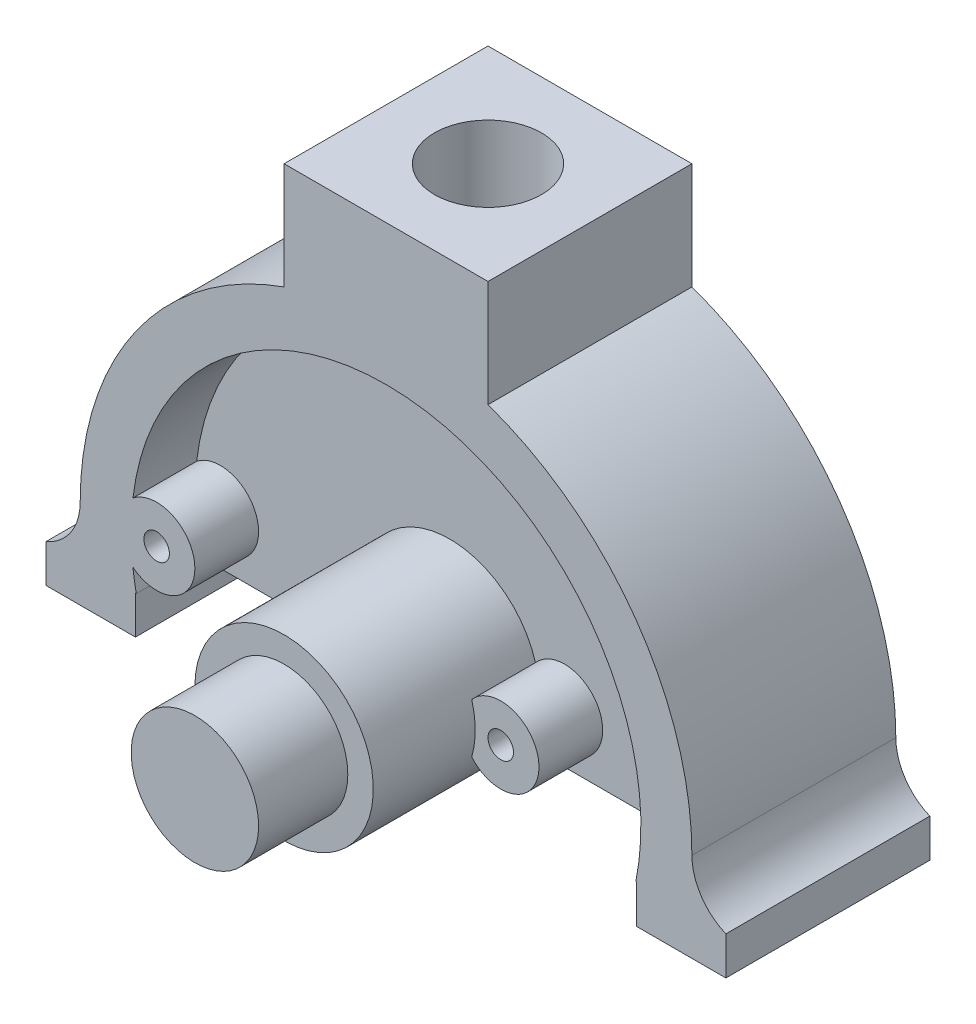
ISO-10303-21;
HEADER;
FILE_DESCRIPTION(('STEP AP214'),'2;1');
FILE_NAME('part.step','',(''),(''),'','','');
FILE_SCHEMA(('AUTOMOTIVE_DESIGN { 1 0 10303 214 1 1 1 1 }'));
ENDSEC;
DATA;
#1=APPLICATION_CONTEXT('core data for automotive mechanical design processes');
#2=APPLICATION_PROTOCOL_DEFINITION('international standard','automotive_design',2000,#1);
#3=PRODUCT_CONTEXT('',#1,'mechanical');
#4=PRODUCT('Part','Part','',(#3));
#5=PRODUCT_RELATED_PRODUCT_CATEGORY('part','',(#4));
#6=PRODUCT_DEFINITION_FORMATION('','',#4);
#7=PRODUCT_DEFINITION_CONTEXT('part definition',#1,'design');
#8=PRODUCT_DEFINITION('design','',#6,#7);
#9=PRODUCT_DEFINITION_SHAPE('','',#8);
#10=(LENGTH_UNIT() NAMED_UNIT(*) SI_UNIT(.MILLI.,.METRE.));
#11=(NAMED_UNIT(*) PLANE_ANGLE_UNIT() SI_UNIT($,.RADIAN.));
#12=(NAMED_UNIT(*) SI_UNIT($,.STERADIAN.) SOLID_ANGLE_UNIT());
#13=UNCERTAINTY_MEASURE_WITH_UNIT(LENGTH_MEASURE(1.E-05),#10,'distance_accuracy_value','');
#14=(GEOMETRIC_REPRESENTATION_CONTEXT(3) GLOBAL_UNCERTAINTY_ASSIGNED_CONTEXT((#13)) GLOBAL_UNIT_ASSIGNED_CONTEXT((#10,
#11,#12)) REPRESENTATION_CONTEXT('',''));
#15=CARTESIAN_POINT('',(0.,0.,0.));
#16=DIRECTION('',(0.,0.,1.));
#17=DIRECTION('',(1.,0.,0.));
#18=AXIS2_PLACEMENT_3D('',#15,#16,#17);
#19=CARTESIAN_POINT('',(0.,10.5000000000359,3.99999999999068));
#20=DIRECTION('',(0.,1.,0.));
#21=DIRECTION('',(0.,0.,1.));
#22=AXIS2_PLACEMENT_3D('',#19,#20,#21);
#23=CONICAL_SURFACE('',#22,2.10000000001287,1.02974425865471);
#24=CARTESIAN_POINT('',(0.,9.23819270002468,3.99999999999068));
#25=VERTEX_POINT('',#24);
#26=VERTEX_LOOP('',#25);
#27=FACE_BOUND('',#26,.T.);
#28=CARTESIAN_POINT('',(0.,10.5,3.99999999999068));
#29=DIRECTION('',(0.,1.,0.));
#30=DIRECTION('',(0.,0.,1.));
#31=AXIS2_PLACEMENT_3D('',#28,#29,#30);
#32=CIRCLE('',#31,2.09999999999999);
#33=CARTESIAN_POINT('',(0.,10.5,6.09999999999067));
#34=VERTEX_POINT('',#33);
#35=EDGE_CURVE('E209',#34,#34,#32,.T.);
#36=ORIENTED_EDGE('',*,*,#35,.T.);
#37=EDGE_LOOP('',(#36));
#38=FACE_BOUND('',#37,.T.);
#39=ADVANCED_FACE('F17',(#27,#38),#23,.F.);
#40=CARTESIAN_POINT('',(0.,0.,5.5));
#41=DIRECTION('',(0.,0.,-1.));
#42=DIRECTION('',(-1.,0.,0.));
#43=AXIS2_PLACEMENT_3D('',#40,#41,#42);
#44=PLANE('',#43);
#45=CARTESIAN_POINT('',(4.5,0.,5.5));
#46=DIRECTION('',(0.,0.,-1.));
#47=DIRECTION('',(-1.,0.,0.));
#48=AXIS2_PLACEMENT_3D('',#45,#46,#47);
#49=CIRCLE('',#48,0.5);
#50=CARTESIAN_POINT('',(4.,0.,5.5));
#51=VERTEX_POINT('',#50);
#52=EDGE_CURVE('E20',#51,#51,#49,.F.);
#53=ORIENTED_EDGE('',*,*,#52,.T.);
#54=EDGE_LOOP('',(#53));
#55=FACE_BOUND('',#54,.T.);
#56=ADVANCED_FACE('F476',(#55),#44,.F.);
#57=CARTESIAN_POINT('',(0.,0.,5.5));
#58=DIRECTION('',(0.,0.,-1.));
#59=DIRECTION('',(-1.,0.,0.));
#60=AXIS2_PLACEMENT_3D('',#57,#58,#59);
#61=PLANE('',#60);
#62=CARTESIAN_POINT('',(-9.,0.,5.5));
#63=DIRECTION('',(0.,0.,-1.));
#64=DIRECTION('',(-1.,0.,0.));
#65=AXIS2_PLACEMENT_3D('',#62,#63,#64);
#66=CIRCLE('',#65,0.5);
#67=CARTESIAN_POINT('',(-9.5,0.,5.5));
#68=VERTEX_POINT('',#67);
#69=EDGE_CURVE('E193',#68,#68,#66,.F.);
#70=ORIENTED_EDGE('',*,*,#69,.T.);
#71=EDGE_LOOP('',(#70));
#72=FACE_BOUND('',#71,.T.);
#73=ADVANCED_FACE('F482',(#72),#61,.F.);
#74=CARTESIAN_POINT('',(0.,15.5,3.99999999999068));
#75=DIRECTION('',(0.,1.,0.));
#76=DIRECTION('',(0.,0.,1.));
#77=AXIS2_PLACEMENT_3D('',#74,#75,#76);
#78=CYLINDRICAL_SURFACE('',#77,2.09999999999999);
#79=CARTESIAN_POINT('',(0.,15.5,3.99999999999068));
#80=DIRECTION('',(0.,1.,0.));
#81=DIRECTION('',(0.,0.,1.));
#82=AXIS2_PLACEMENT_3D('',#79,#80,#81);
#83=CIRCLE('',#82,2.09999999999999);
#84=CARTESIAN_POINT('',(0.,15.5,6.09999999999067));
#85=VERTEX_POINT('',#84);
#86=EDGE_CURVE('E189',#85,#85,#83,.F.);
#87=ORIENTED_EDGE('',*,*,#86,.F.);
#88=EDGE_LOOP('',(#87));
#89=FACE_BOUND('',#88,.T.);
#90=ORIENTED_EDGE('',*,*,#35,.F.);
#91=EDGE_LOOP('',(#90));
#92=FACE_BOUND('',#91,.T.);
#93=ADVANCED_FACE('F479',(#89,#92),#78,.F.);
#94=CARTESIAN_POINT('',(-13.3321595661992,-3.5,8.));
#95=DIRECTION('',(1.,0.,0.));
#96=DIRECTION('',(0.,1.,0.));
#97=AXIS2_PLACEMENT_3D('',#94,#95,#96);
#98=PLANE('',#97);
#99=DIRECTION('',(0.,0.,1.));
#100=VECTOR('',#99,1.);
#101=CARTESIAN_POINT('',(-13.3321595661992,-3.5,8.));
#102=LINE('',#101,#100);
#103=CARTESIAN_POINT('',(-13.3321595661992,-3.5,0.));
#104=VERTEX_POINT('',#103);
#105=CARTESIAN_POINT('',(-13.3321595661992,-3.5,8.));
#106=VERTEX_POINT('',#105);
#107=EDGE_CURVE('E188',#104,#106,#102,.T.);
#108=ORIENTED_EDGE('',*,*,#107,.T.);
#109=DIRECTION('',(0.,1.,0.));
#110=VECTOR('',#109,1.);
#111=CARTESIAN_POINT('',(-13.3321595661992,-3.5,8.));
#112=LINE('',#111,#110);
#113=CARTESIAN_POINT('',(-13.3321595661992,-2.,8.));
#114=VERTEX_POINT('',#113);
#115=EDGE_CURVE('E204',#114,#106,#112,.F.);
#116=ORIENTED_EDGE('',*,*,#115,.F.);
#117=DIRECTION('',(0.,0.,-1.));
#118=VECTOR('',#117,1.);
#119=CARTESIAN_POINT('',(-13.3321595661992,-2.,8.));
#120=LINE('',#119,#118);
#121=CARTESIAN_POINT('',(-13.3321595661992,-2.,0.));
#122=VERTEX_POINT('',#121);
#123=EDGE_CURVE('E155',#114,#122,#120,.T.);
#124=ORIENTED_EDGE('',*,*,#123,.T.);
#125=DIRECTION('',(0.,1.,0.));
#126=VECTOR('',#125,1.);
#127=CARTESIAN_POINT('',(-13.3321595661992,-3.5,0.));
#128=LINE('',#127,#126);
#129=EDGE_CURVE('E201',#104,#122,#128,.T.);
#130=ORIENTED_EDGE('',*,*,#129,.F.);
#131=EDGE_LOOP('',(#108,#116,#124,#130));
#132=FACE_BOUND('',#131,.T.);
#133=ADVANCED_FACE('F481',(#132),#98,.F.);
#134=CARTESIAN_POINT('',(0.,0.,15.5));
#135=DIRECTION('',(0.,0.,-1.));
#136=DIRECTION('',(-1.,0.,0.));
#137=AXIS2_PLACEMENT_3D('',#134,#135,#136);
#138=PLANE('',#137);
#139=CARTESIAN_POINT('',(0.,0.,15.5));
#140=DIRECTION('',(0.,0.,1.));
#141=DIRECTION('',(1.,0.,0.));
#142=AXIS2_PLACEMENT_3D('',#139,#140,#141);
#143=CIRCLE('',#142,2.5);
#144=CARTESIAN_POINT('',(2.5,0.,15.5));
#145=VERTEX_POINT('',#144);
#146=EDGE_CURVE('E185',#145,#145,#143,.F.);
#147=ORIENTED_EDGE('',*,*,#146,.F.);
#148=EDGE_LOOP('',(#147));
#149=FACE_BOUND('',#148,.T.);
#150=ADVANCED_FACE('F490',(#149),#138,.F.);
#151=CARTESIAN_POINT('',(0.,0.,-4.5));
#152=DIRECTION('',(0.,0.,-1.));
#153=DIRECTION('',(-1.,0.,0.));
#154=AXIS2_PLACEMENT_3D('',#151,#152,#153);
#155=PLANE('',#154);
#156=CARTESIAN_POINT('',(0.,0.,-4.5));
#157=DIRECTION('',(0.,0.,-1.));
#158=DIRECTION('',(-1.,0.,0.));
#159=AXIS2_PLACEMENT_3D('',#156,#157,#158);
#160=CIRCLE('',#159,2.5);
#161=CARTESIAN_POINT('',(-2.5,0.,-4.5));
#162=VERTEX_POINT('',#161);
#163=EDGE_CURVE('E182',#162,#162,#160,.F.);
#164=ORIENTED_EDGE('',*,*,#163,.F.);
#165=EDGE_LOOP('',(#164));
#166=FACE_BOUND('',#165,.T.);
#167=ADVANCED_FACE('F607',(#166),#155,.T.);
#168=CARTESIAN_POINT('',(4.5,0.,8.));
#169=DIRECTION('',(0.,0.,-1.));
#170=DIRECTION('',(-1.,0.,0.));
#171=AXIS2_PLACEMENT_3D('',#168,#169,#170);
#172=CYLINDRICAL_SURFACE('',#171,0.5);
#173=CARTESIAN_POINT('',(4.5,0.,8.));
#174=DIRECTION('',(0.,0.,-1.));
#175=DIRECTION('',(-1.,0.,0.));
#176=AXIS2_PLACEMENT_3D('',#173,#174,#175);
#177=CIRCLE('',#176,0.5);
#178=CARTESIAN_POINT('',(4.,0.,8.));
#179=VERTEX_POINT('',#178);
#180=EDGE_CURVE('E179',#179,#179,#177,.T.);
#181=ORIENTED_EDGE('',*,*,#180,.F.);
#182=EDGE_LOOP('',(#181));
#183=FACE_BOUND('',#182,.T.);
#184=ORIENTED_EDGE('',*,*,#52,.F.);
#185=EDGE_LOOP('',(#184));
#186=FACE_BOUND('',#185,.T.);
#187=ADVANCED_FACE('F603',(#183,#186),#172,.F.);
#188=CARTESIAN_POINT('',(-9.,0.,8.));
#189=DIRECTION('',(0.,0.,-1.));
#190=DIRECTION('',(-1.,0.,0.));
#191=AXIS2_PLACEMENT_3D('',#188,#189,#190);
#192=CYLINDRICAL_SURFACE('',#191,0.5);
#193=ORIENTED_EDGE('',*,*,#69,.F.);
#194=EDGE_LOOP('',(#193));
#195=FACE_BOUND('',#194,.T.);
#196=CARTESIAN_POINT('',(-9.,0.,8.));
#197=DIRECTION('',(0.,0.,-1.));
#198=DIRECTION('',(-1.,0.,0.));
#199=AXIS2_PLACEMENT_3D('',#196,#197,#198);
#200=CIRCLE('',#199,0.5);
#201=CARTESIAN_POINT('',(-9.5,0.,8.));
#202=VERTEX_POINT('',#201);
#203=EDGE_CURVE('E309',#202,#202,#200,.F.);
#204=ORIENTED_EDGE('',*,*,#203,.T.);
#205=EDGE_LOOP('',(#204));
#206=FACE_BOUND('',#205,.T.);
#207=ADVANCED_FACE('F600',(#195,#206),#192,.F.);
#208=CARTESIAN_POINT('',(13.3321595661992,-3.5,8.));
#209=DIRECTION('',(-1.,0.,0.));
#210=DIRECTION('',(0.,-1.,0.));
#211=AXIS2_PLACEMENT_3D('',#208,#209,#210);
#212=PLANE('',#211);
#213=DIRECTION('',(0.,0.,-1.));
#214=VECTOR('',#213,1.);
#215=CARTESIAN_POINT('',(13.3321595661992,-2.,8.));
#216=LINE('',#215,#214);
#217=CARTESIAN_POINT('',(13.3321595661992,-2.,0.));
#218=VERTEX_POINT('',#217);
#219=CARTESIAN_POINT('',(13.3321595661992,-2.,8.));
#220=VERTEX_POINT('',#219);
#221=EDGE_CURVE('E369',#218,#220,#216,.F.);
#222=ORIENTED_EDGE('',*,*,#221,.T.);
#223=DIRECTION('',(0.,1.,0.));
#224=VECTOR('',#223,1.);
#225=CARTESIAN_POINT('',(13.3321595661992,1.00665441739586E-13,8.));
#226=LINE('',#225,#224);
#227=CARTESIAN_POINT('',(13.3321595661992,-3.5,8.));
#228=VERTEX_POINT('',#227);
#229=EDGE_CURVE('E316',#220,#228,#226,.F.);
#230=ORIENTED_EDGE('',*,*,#229,.T.);
#231=DIRECTION('',(0.,0.,1.));
#232=VECTOR('',#231,1.);
#233=CARTESIAN_POINT('',(13.3321595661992,-3.5,8.));
#234=LINE('',#233,#232);
#235=CARTESIAN_POINT('',(13.3321595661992,-3.5,0.));
#236=VERTEX_POINT('',#235);
#237=EDGE_CURVE('E308',#228,#236,#234,.F.);
#238=ORIENTED_EDGE('',*,*,#237,.T.);
#239=DIRECTION('',(0.,-1.,0.));
#240=VECTOR('',#239,1.);
#241=CARTESIAN_POINT('',(13.3321595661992,-3.5,0.));
#242=LINE('',#241,#240);
#243=EDGE_CURVE('E195',#218,#236,#242,.T.);
#244=ORIENTED_EDGE('',*,*,#243,.F.);
#245=EDGE_LOOP('',(#222,#230,#238,#244));
#246=FACE_BOUND('',#245,.T.);
#247=ADVANCED_FACE('F446',(#246),#212,.F.);
#248=CARTESIAN_POINT('',(0.,0.,8.));
#249=DIRECTION('',(0.,0.,-1.));
#250=DIRECTION('',(-1.,0.,0.));
#251=AXIS2_PLACEMENT_3D('',#248,#249,#250);
#252=CYLINDRICAL_SURFACE('',#251,12.);
#253=DIRECTION('',(0.,0.,-1.));
#254=VECTOR('',#253,1.);
#255=CARTESIAN_POINT('',(-12.,0.,8.));
#256=LINE('',#255,#254);
#257=CARTESIAN_POINT('',(-12.,0.,0.));
#258=VERTEX_POINT('',#257);
#259=CARTESIAN_POINT('',(-12.,0.,8.));
#260=VERTEX_POINT('',#259);
#261=EDGE_CURVE('E145',#258,#260,#256,.F.);
#262=ORIENTED_EDGE('',*,*,#261,.T.);
#263=CARTESIAN_POINT('',(0.,0.,8.));
#264=DIRECTION('',(0.,0.,-1.));
#265=DIRECTION('',(-1.,0.,0.));
#266=AXIS2_PLACEMENT_3D('',#263,#264,#265);
#267=CIRCLE('',#266,12.);
#268=CARTESIAN_POINT('',(-4.0000000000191,11.313708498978,7.99999999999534));
#269=VERTEX_POINT('',#268);
#270=EDGE_CURVE('E149',#260,#269,#267,.T.);
#271=ORIENTED_EDGE('',*,*,#270,.T.);
#272=DIRECTION('',(0.,0.,1.));
#273=VECTOR('',#272,1.);
#274=CARTESIAN_POINT('',(-4.0000000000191,11.313708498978,291599.6));
#275=LINE('',#274,#273);
#276=CARTESIAN_POINT('',(-4.0000000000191,11.313708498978,0.));
#277=VERTEX_POINT('',#276);
#278=EDGE_CURVE('E192',#269,#277,#275,.F.);
#279=ORIENTED_EDGE('',*,*,#278,.T.);
#280=CARTESIAN_POINT('',(0.,0.,0.));
#281=DIRECTION('',(0.,0.,-1.));
#282=DIRECTION('',(-1.,0.,0.));
#283=AXIS2_PLACEMENT_3D('',#280,#281,#282);
#284=CIRCLE('',#283,12.);
#285=EDGE_CURVE('E150',#258,#277,#284,.T.);
#286=ORIENTED_EDGE('',*,*,#285,.F.);
#287=EDGE_LOOP('',(#262,#271,#279,#286));
#288=FACE_BOUND('',#287,.T.);
#289=ADVANCED_FACE('F147',(#288),#252,.T.);
#290=CARTESIAN_POINT('',(-4.0000000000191,12.,291599.6));
#291=DIRECTION('',(1.,0.,0.));
#292=DIRECTION('',(0.,1.,0.));
#293=AXIS2_PLACEMENT_3D('',#290,#291,#292);
#294=PLANE('',#293);
#295=ORIENTED_EDGE('',*,*,#278,.F.);
#296=DIRECTION('',(0.,1.,0.));
#297=VECTOR('',#296,1.);
#298=CARTESIAN_POINT('',(-4.0000000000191,1.00665441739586E-13,8.));
#299=LINE('',#298,#297);
#300=CARTESIAN_POINT('',(-4.0000000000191,15.5,7.99999999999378));
#301=VERTEX_POINT('',#300);
#302=EDGE_CURVE('E167',#269,#301,#299,.T.);
#303=ORIENTED_EDGE('',*,*,#302,.T.);
#304=DIRECTION('',(0.,0.,1.));
#305=VECTOR('',#304,1.);
#306=CARTESIAN_POINT('',(-4.0000000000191,15.5,291599.6));
#307=LINE('',#306,#305);
#308=CARTESIAN_POINT('',(-4.0000000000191,15.5,0.));
#309=VERTEX_POINT('',#308);
#310=EDGE_CURVE('E191',#309,#301,#307,.T.);
#311=ORIENTED_EDGE('',*,*,#310,.F.);
#312=DIRECTION('',(0.,1.,0.));
#313=VECTOR('',#312,1.);
#314=CARTESIAN_POINT('',(-4.0000000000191,1.00665441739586E-13,0.));
#315=LINE('',#314,#313);
#316=EDGE_CURVE('E304',#277,#309,#315,.T.);
#317=ORIENTED_EDGE('',*,*,#316,.F.);
#318=EDGE_LOOP('',(#295,#303,#311,#317));
#319=FACE_BOUND('',#318,.T.);
#320=ADVANCED_FACE('F591',(#319),#294,.F.);
#321=CARTESIAN_POINT('',(-399999.524210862,15.5,291599.6));
#322=DIRECTION('',(0.,1.,0.));
#323=DIRECTION('',(0.,0.,1.));
#324=AXIS2_PLACEMENT_3D('',#321,#322,#323);
#325=PLANE('',#324);
#326=DIRECTION('',(0.,0.,1.));
#327=VECTOR('',#326,1.);
#328=CARTESIAN_POINT('',(4.00000000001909,15.5,291599.6));
#329=LINE('',#328,#327);
#330=CARTESIAN_POINT('',(4.00000000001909,15.5,7.99999999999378));
#331=VERTEX_POINT('',#330);
#332=CARTESIAN_POINT('',(4.00000000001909,15.5,0.));
#333=VERTEX_POINT('',#332);
#334=EDGE_CURVE('E373',#331,#333,#329,.F.);
#335=ORIENTED_EDGE('',*,*,#334,.T.);
#336=DIRECTION('',(-1.,0.,0.));
#337=VECTOR('',#336,1.);
#338=CARTESIAN_POINT('',(-14.167401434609,15.5,0.));
#339=LINE('',#338,#337);
#340=EDGE_CURVE('E378',#309,#333,#339,.F.);
#341=ORIENTED_EDGE('',*,*,#340,.F.);
#342=ORIENTED_EDGE('',*,*,#310,.T.);
#343=DIRECTION('',(-1.,0.,0.));
#344=VECTOR('',#343,1.);
#345=CARTESIAN_POINT('',(-14.167401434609,15.5,8.));
#346=LINE('',#345,#344);
#347=EDGE_CURVE('E324',#301,#331,#346,.F.);
#348=ORIENTED_EDGE('',*,*,#347,.T.);
#349=EDGE_LOOP('',(#335,#341,#342,#348));
#350=FACE_BOUND('',#349,.T.);
#351=ORIENTED_EDGE('',*,*,#86,.T.);
#352=EDGE_LOOP('',(#351));
#353=FACE_BOUND('',#352,.T.);
#354=ADVANCED_FACE('F588',(#350,#353),#325,.T.);
#355=CARTESIAN_POINT('',(4.0000000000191,12.,291599.6));
#356=DIRECTION('',(-1.,0.,0.));
#357=DIRECTION('',(0.,-1.,0.));
#358=AXIS2_PLACEMENT_3D('',#355,#356,#357);
#359=PLANE('',#358);
#360=DIRECTION('',(0.,0.,-1.));
#361=VECTOR('',#360,1.);
#362=CARTESIAN_POINT('',(4.0000000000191,11.313708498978,8.));
#363=LINE('',#362,#361);
#364=CARTESIAN_POINT('',(4.0000000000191,11.313708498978,0.));
#365=VERTEX_POINT('',#364);
#366=CARTESIAN_POINT('',(4.0000000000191,11.313708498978,7.99999999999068));
#367=VERTEX_POINT('',#366);
#368=EDGE_CURVE('E371',#365,#367,#363,.F.);
#369=ORIENTED_EDGE('',*,*,#368,.F.);
#370=DIRECTION('',(0.,1.,0.));
#371=VECTOR('',#370,1.);
#372=CARTESIAN_POINT('',(4.00000000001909,1.00665441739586E-13,0.));
#373=LINE('',#372,#371);
#374=EDGE_CURVE('E302',#333,#365,#373,.F.);
#375=ORIENTED_EDGE('',*,*,#374,.F.);
#376=ORIENTED_EDGE('',*,*,#334,.F.);
#377=DIRECTION('',(0.,1.,0.));
#378=VECTOR('',#377,1.);
#379=CARTESIAN_POINT('',(4.00000000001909,1.00665441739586E-13,8.));
#380=LINE('',#379,#378);
#381=EDGE_CURVE('E319',#331,#367,#380,.F.);
#382=ORIENTED_EDGE('',*,*,#381,.T.);
#383=EDGE_LOOP('',(#369,#375,#376,#382));
#384=FACE_BOUND('',#383,.T.);
#385=ADVANCED_FACE('F585',(#384),#359,.F.);
#386=CARTESIAN_POINT('',(0.,0.,8.));
#387=DIRECTION('',(0.,0.,-1.));
#388=DIRECTION('',(-1.,0.,0.));
#389=AXIS2_PLACEMENT_3D('',#386,#387,#388);
#390=CYLINDRICAL_SURFACE('',#389,12.);
#391=DIRECTION('',(0.,0.,-1.));
#392=VECTOR('',#391,1.);
#393=CARTESIAN_POINT('',(12.,1.00665441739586E-13,8.));
#394=LINE('',#393,#392);
#395=CARTESIAN_POINT('',(12.,1.00665441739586E-13,7.99999999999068));
#396=VERTEX_POINT('',#395);
#397=CARTESIAN_POINT('',(12.,0.,0.));
#398=VERTEX_POINT('',#397);
#399=EDGE_CURVE('E156',#396,#398,#394,.T.);
#400=ORIENTED_EDGE('',*,*,#399,.T.);
#401=CARTESIAN_POINT('',(0.,0.,0.));
#402=DIRECTION('',(0.,0.,-1.));
#403=DIRECTION('',(-1.,0.,0.));
#404=AXIS2_PLACEMENT_3D('',#401,#402,#403);
#405=CIRCLE('',#404,12.);
#406=EDGE_CURVE('E300',#365,#398,#405,.T.);
#407=ORIENTED_EDGE('',*,*,#406,.F.);
#408=ORIENTED_EDGE('',*,*,#368,.T.);
#409=CARTESIAN_POINT('',(0.,0.,7.99999999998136));
#410=DIRECTION('',(0.,0.,-1.));
#411=DIRECTION('',(-1.,0.,0.));
#412=AXIS2_PLACEMENT_3D('',#409,#410,#411);
#413=CIRCLE('',#412,12.);
#414=EDGE_CURVE('E317',#367,#396,#413,.T.);
#415=ORIENTED_EDGE('',*,*,#414,.T.);
#416=EDGE_LOOP('',(#400,#407,#408,#415));
#417=FACE_BOUND('',#416,.T.);
#418=ADVANCED_FACE('F581',(#417),#390,.T.);
#419=CARTESIAN_POINT('',(14.167401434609,1.00665441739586E-13,8.));
#420=DIRECTION('',(0.,0.,-1.));
#421=DIRECTION('',(-1.,0.,0.));
#422=AXIS2_PLACEMENT_3D('',#419,#420,#421);
#423=CYLINDRICAL_SURFACE('',#422,2.16740143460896);
#424=ORIENTED_EDGE('',*,*,#399,.F.);
#425=CARTESIAN_POINT('',(14.167401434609,1.00665441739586E-13,8.));
#426=DIRECTION('',(0.,0.,-1.));
#427=DIRECTION('',(-1.,0.,0.));
#428=AXIS2_PLACEMENT_3D('',#425,#426,#427);
#429=CIRCLE('',#428,2.16740143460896);
#430=EDGE_CURVE('E314',#396,#220,#429,.F.);
#431=ORIENTED_EDGE('',*,*,#430,.T.);
#432=ORIENTED_EDGE('',*,*,#221,.F.);
#433=CARTESIAN_POINT('',(14.167401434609,1.00665441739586E-13,0.));
#434=DIRECTION('',(0.,0.,-1.));
#435=DIRECTION('',(-1.,0.,0.));
#436=AXIS2_PLACEMENT_3D('',#433,#434,#435);
#437=CIRCLE('',#436,2.16740143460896);
#438=EDGE_CURVE('E222',#398,#218,#437,.F.);
#439=ORIENTED_EDGE('',*,*,#438,.F.);
#440=EDGE_LOOP('',(#424,#431,#432,#439));
#441=FACE_BOUND('',#440,.T.);
#442=ADVANCED_FACE('F578',(#441),#423,.F.);
#443=CARTESIAN_POINT('',(-14.167401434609,1.00665441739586E-13,8.));
#444=DIRECTION('',(0.,0.,-1.));
#445=DIRECTION('',(-1.,0.,0.));
#446=AXIS2_PLACEMENT_3D('',#443,#444,#445);
#447=CYLINDRICAL_SURFACE('',#446,2.16740143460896);
#448=ORIENTED_EDGE('',*,*,#123,.F.);
#449=CARTESIAN_POINT('',(-14.167401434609,1.00665441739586E-13,8.));
#450=DIRECTION('',(0.,0.,-1.));
#451=DIRECTION('',(-1.,0.,0.));
#452=AXIS2_PLACEMENT_3D('',#449,#450,#451);
#453=CIRCLE('',#452,2.16740143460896);
#454=EDGE_CURVE('E164',#114,#260,#453,.F.);
#455=ORIENTED_EDGE('',*,*,#454,.T.);
#456=ORIENTED_EDGE('',*,*,#261,.F.);
#457=CARTESIAN_POINT('',(-14.167401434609,1.00665441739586E-13,0.));
#458=DIRECTION('',(0.,0.,-1.));
#459=DIRECTION('',(-1.,0.,0.));
#460=AXIS2_PLACEMENT_3D('',#457,#458,#459);
#461=CIRCLE('',#460,2.16740143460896);
#462=EDGE_CURVE('E231',#122,#258,#461,.F.);
#463=ORIENTED_EDGE('',*,*,#462,.F.);
#464=EDGE_LOOP('',(#448,#455,#456,#463));
#465=FACE_BOUND('',#464,.T.);
#466=ADVANCED_FACE('F170',(#465),#447,.F.);
#467=CARTESIAN_POINT('',(-9.83215956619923,-3.5,8.));
#468=DIRECTION('',(0.,1.,0.));
#469=DIRECTION('',(-1.,0.,0.));
#470=AXIS2_PLACEMENT_3D('',#467,#468,#469);
#471=PLANE('',#470);
#472=DIRECTION('',(0.,0.,1.));
#473=VECTOR('',#472,1.);
#474=CARTESIAN_POINT('',(-9.83215956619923,-3.5,8.));
#475=LINE('',#474,#473);
#476=CARTESIAN_POINT('',(-9.83215956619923,-3.5,0.));
#477=VERTEX_POINT('',#476);
#478=CARTESIAN_POINT('',(-9.83215956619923,-3.5,8.));
#479=VERTEX_POINT('',#478);
#480=EDGE_CURVE('E297',#477,#479,#475,.T.);
#481=ORIENTED_EDGE('',*,*,#480,.T.);
#482=DIRECTION('',(-1.,0.,0.));
#483=VECTOR('',#482,1.);
#484=CARTESIAN_POINT('',(-14.167401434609,-3.5,8.));
#485=LINE('',#484,#483);
#486=EDGE_CURVE('E172',#479,#106,#485,.T.);
#487=ORIENTED_EDGE('',*,*,#486,.T.);
#488=ORIENTED_EDGE('',*,*,#107,.F.);
#489=DIRECTION('',(-1.,0.,0.));
#490=VECTOR('',#489,1.);
#491=CARTESIAN_POINT('',(-14.167401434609,-3.5,0.));
#492=LINE('',#491,#490);
#493=EDGE_CURVE('E229',#477,#104,#492,.T.);
#494=ORIENTED_EDGE('',*,*,#493,.F.);
#495=EDGE_LOOP('',(#481,#487,#488,#494));
#496=FACE_BOUND('',#495,.T.);
#497=ADVANCED_FACE('F572',(#496),#471,.F.);
#498=CARTESIAN_POINT('',(0.,0.,12.));
#499=DIRECTION('',(0.,0.,1.));
#500=DIRECTION('',(1.,0.,0.));
#501=AXIS2_PLACEMENT_3D('',#498,#499,#500);
#502=CYLINDRICAL_SURFACE('',#501,2.5);
#503=CARTESIAN_POINT('',(0.,0.,12.));
#504=DIRECTION('',(0.,0.,1.));
#505=DIRECTION('',(1.,0.,0.));
#506=AXIS2_PLACEMENT_3D('',#503,#504,#505);
#507=CIRCLE('',#506,2.5);
#508=CARTESIAN_POINT('',(2.5,0.,12.));
#509=VERTEX_POINT('',#508);
#510=EDGE_CURVE('E288',#509,#509,#507,.F.);
#511=ORIENTED_EDGE('',*,*,#510,.F.);
#512=EDGE_LOOP('',(#511));
#513=FACE_BOUND('',#512,.T.);
#514=ORIENTED_EDGE('',*,*,#146,.T.);
#515=EDGE_LOOP('',(#514));
#516=FACE_BOUND('',#515,.T.);
#517=ADVANCED_FACE('F568',(#513,#516),#502,.T.);
#518=CARTESIAN_POINT('',(0.,0.,-1.));
#519=DIRECTION('',(0.,0.,-1.));
#520=DIRECTION('',(-1.,0.,0.));
#521=AXIS2_PLACEMENT_3D('',#518,#519,#520);
#522=CYLINDRICAL_SURFACE('',#521,2.5);
#523=CARTESIAN_POINT('',(0.,0.,-1.));
#524=DIRECTION('',(0.,0.,-1.));
#525=DIRECTION('',(-1.,0.,0.));
#526=AXIS2_PLACEMENT_3D('',#523,#524,#525);
#527=CIRCLE('',#526,2.5);
#528=CARTESIAN_POINT('',(-2.5,0.,-1.));
#529=VERTEX_POINT('',#528);
#530=EDGE_CURVE('E283',#529,#529,#527,.F.);
#531=ORIENTED_EDGE('',*,*,#530,.F.);
#532=EDGE_LOOP('',(#531));
#533=FACE_BOUND('',#532,.T.);
#534=ORIENTED_EDGE('',*,*,#163,.T.);
#535=EDGE_LOOP('',(#534));
#536=FACE_BOUND('',#535,.T.);
#537=ADVANCED_FACE('F564',(#533,#536),#522,.T.);
#538=CARTESIAN_POINT('',(4.5,0.,8.));
#539=DIRECTION('',(0.,0.,1.));
#540=DIRECTION('',(1.,0.,0.));
#541=AXIS2_PLACEMENT_3D('',#538,#539,#540);
#542=PLANE('',#541);
#543=ORIENTED_EDGE('',*,*,#180,.T.);
#544=EDGE_LOOP('',(#543));
#545=FACE_BOUND('',#544,.T.);
#546=CARTESIAN_POINT('',(0.,0.,8.));
#547=DIRECTION('',(0.,0.,-1.));
#548=DIRECTION('',(-1.,0.,0.));
#549=AXIS2_PLACEMENT_3D('',#546,#547,#548);
#550=CIRCLE('',#549,3.5);
#551=CARTESIAN_POINT('',(3.36111111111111,-0.976182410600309,8.));
#552=VERTEX_POINT('',#551);
#553=CARTESIAN_POINT('',(3.36111111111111,0.97618241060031,8.));
#554=VERTEX_POINT('',#553);
#555=EDGE_CURVE('E286',#552,#554,#550,.F.);
#556=ORIENTED_EDGE('',*,*,#555,.F.);
#557=CARTESIAN_POINT('',(4.5,0.,8.));
#558=DIRECTION('',(0.,0.,-1.));
#559=DIRECTION('',(-1.,0.,0.));
#560=AXIS2_PLACEMENT_3D('',#557,#558,#559);
#561=CIRCLE('',#560,1.5);
#562=EDGE_CURVE('E279',#554,#552,#561,.T.);
#563=ORIENTED_EDGE('',*,*,#562,.F.);
#564=EDGE_LOOP('',(#556,#563));
#565=FACE_BOUND('',#564,.T.);
#566=ADVANCED_FACE('F560',(#545,#565),#542,.T.);
#567=CARTESIAN_POINT('',(-14.167401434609,1.00665441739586E-13,8.));
#568=DIRECTION('',(0.,0.,-1.));
#569=DIRECTION('',(-1.,0.,0.));
#570=AXIS2_PLACEMENT_3D('',#567,#568,#569);
#571=PLANE('',#570);
#572=ORIENTED_EDGE('',*,*,#203,.F.);
#573=EDGE_LOOP('',(#572));
#574=FACE_BOUND('',#573,.T.);
#575=CARTESIAN_POINT('',(-9.,0.,8.));
#576=DIRECTION('',(0.,0.,-1.));
#577=DIRECTION('',(-1.,0.,0.));
#578=AXIS2_PLACEMENT_3D('',#575,#576,#577);
#579=CIRCLE('',#578,1.5);
#580=CARTESIAN_POINT('',(-9.93055555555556,1.17646349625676,8.));
#581=VERTEX_POINT('',#580);
#582=CARTESIAN_POINT('',(-9.93055555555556,-1.17646349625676,8.));
#583=VERTEX_POINT('',#582);
#584=EDGE_CURVE('E306',#581,#583,#579,.T.);
#585=ORIENTED_EDGE('',*,*,#584,.F.);
#586=CARTESIAN_POINT('',(0.,0.,8.));
#587=DIRECTION('',(0.,0.,1.));
#588=DIRECTION('',(1.,0.,0.));
#589=AXIS2_PLACEMENT_3D('',#586,#587,#588);
#590=CIRCLE('',#589,10.);
#591=CARTESIAN_POINT('',(9.79795897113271,-2.,8.));
#592=VERTEX_POINT('',#591);
#593=EDGE_CURVE('E275',#581,#592,#590,.F.);
#594=ORIENTED_EDGE('',*,*,#593,.T.);
#595=DIRECTION('',(-1.,0.,0.));
#596=VECTOR('',#595,1.);
#597=CARTESIAN_POINT('',(-14.167401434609,-2.,8.));
#598=LINE('',#597,#596);
#599=CARTESIAN_POINT('',(9.83215956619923,-2.,8.));
#600=VERTEX_POINT('',#599);
#601=EDGE_CURVE('E313',#600,#592,#598,.T.);
#602=ORIENTED_EDGE('',*,*,#601,.F.);
#603=DIRECTION('',(0.,1.,0.));
#604=VECTOR('',#603,1.);
#605=CARTESIAN_POINT('',(9.83215956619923,1.00665441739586E-13,8.));
#606=LINE('',#605,#604);
#607=CARTESIAN_POINT('',(9.83215956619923,-3.5,8.));
#608=VERTEX_POINT('',#607);
#609=EDGE_CURVE('E388',#608,#600,#606,.T.);
#610=ORIENTED_EDGE('',*,*,#609,.F.);
#611=DIRECTION('',(-1.,0.,0.));
#612=VECTOR('',#611,1.);
#613=CARTESIAN_POINT('',(9.83215956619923,-3.5,8.));
#614=LINE('',#613,#612);
#615=EDGE_CURVE('E312',#608,#228,#614,.F.);
#616=ORIENTED_EDGE('',*,*,#615,.T.);
#617=ORIENTED_EDGE('',*,*,#229,.F.);
#618=ORIENTED_EDGE('',*,*,#430,.F.);
#619=ORIENTED_EDGE('',*,*,#414,.F.);
#620=ORIENTED_EDGE('',*,*,#381,.F.);
#621=ORIENTED_EDGE('',*,*,#347,.F.);
#622=ORIENTED_EDGE('',*,*,#302,.F.);
#623=ORIENTED_EDGE('',*,*,#270,.F.);
#624=ORIENTED_EDGE('',*,*,#454,.F.);
#625=ORIENTED_EDGE('',*,*,#115,.T.);
#626=ORIENTED_EDGE('',*,*,#486,.F.);
#627=DIRECTION('',(0.,-1.,0.));
#628=VECTOR('',#627,1.);
#629=CARTESIAN_POINT('',(-9.83215956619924,-2.,8.));
#630=LINE('',#629,#628);
#631=CARTESIAN_POINT('',(-9.83215956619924,-2.,8.));
#632=VERTEX_POINT('',#631);
#633=EDGE_CURVE('E348',#479,#632,#630,.F.);
#634=ORIENTED_EDGE('',*,*,#633,.T.);
#635=DIRECTION('',(-1.,0.,0.));
#636=VECTOR('',#635,1.);
#637=CARTESIAN_POINT('',(-14.167401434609,-2.,8.));
#638=LINE('',#637,#636);
#639=CARTESIAN_POINT('',(-9.79795897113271,-2.,8.));
#640=VERTEX_POINT('',#639);
#641=EDGE_CURVE('E175',#640,#632,#638,.T.);
#642=ORIENTED_EDGE('',*,*,#641,.F.);
#643=CARTESIAN_POINT('',(0.,0.,8.));
#644=DIRECTION('',(0.,0.,1.));
#645=DIRECTION('',(1.,0.,0.));
#646=AXIS2_PLACEMENT_3D('',#643,#644,#645);
#647=CIRCLE('',#646,10.);
#648=EDGE_CURVE('E292',#640,#583,#647,.F.);
#649=ORIENTED_EDGE('',*,*,#648,.T.);
#650=EDGE_LOOP('',(#585,#594,#602,#610,#616,#617,#618,#619,#620,#621,#622,#623,#624,#625,#626,
#634,#642,#649));
#651=FACE_BOUND('',#650,.T.);
#652=ADVANCED_FACE('F162',(#574,#651),#571,.F.);
#653=CARTESIAN_POINT('',(9.83215956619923,-3.5,8.));
#654=DIRECTION('',(0.,1.,0.));
#655=DIRECTION('',(-1.,0.,0.));
#656=AXIS2_PLACEMENT_3D('',#653,#654,#655);
#657=PLANE('',#656);
#658=ORIENTED_EDGE('',*,*,#237,.F.);
#659=ORIENTED_EDGE('',*,*,#615,.F.);
#660=DIRECTION('',(0.,0.,1.));
#661=VECTOR('',#660,1.);
#662=CARTESIAN_POINT('',(9.83215956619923,-3.5,8.));
#663=LINE('',#662,#661);
#664=CARTESIAN_POINT('',(9.83215956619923,-3.5,0.));
#665=VERTEX_POINT('',#664);
#666=EDGE_CURVE('E278',#608,#665,#663,.F.);
#667=ORIENTED_EDGE('',*,*,#666,.T.);
#668=DIRECTION('',(-1.,0.,0.));
#669=VECTOR('',#668,1.);
#670=CARTESIAN_POINT('',(-14.167401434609,-3.5,0.));
#671=LINE('',#670,#669);
#672=EDGE_CURVE('E218',#236,#665,#671,.T.);
#673=ORIENTED_EDGE('',*,*,#672,.F.);
#674=EDGE_LOOP('',(#658,#659,#667,#673));
#675=FACE_BOUND('',#674,.T.);
#676=ADVANCED_FACE('F453',(#675),#657,.F.);
#677=CARTESIAN_POINT('',(-9.,0.,8.));
#678=DIRECTION('',(0.,0.,-1.));
#679=DIRECTION('',(-1.,0.,0.));
#680=AXIS2_PLACEMENT_3D('',#677,#678,#679);
#681=CYLINDRICAL_SURFACE('',#680,1.5);
#682=CARTESIAN_POINT('',(-9.,0.,5.5));
#683=DIRECTION('',(0.,0.,-1.));
#684=DIRECTION('',(-1.,0.,0.));
#685=AXIS2_PLACEMENT_3D('',#682,#683,#684);
#686=CIRCLE('',#685,1.5);
#687=CARTESIAN_POINT('',(-9.93055555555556,-1.17646349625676,5.5));
#688=VERTEX_POINT('',#687);
#689=CARTESIAN_POINT('',(-9.93055555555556,1.17646349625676,5.5));
#690=VERTEX_POINT('',#689);
#691=EDGE_CURVE('E262',#688,#690,#686,.F.);
#692=ORIENTED_EDGE('',*,*,#691,.T.);
#693=DIRECTION('',(0.,0.,-1.));
#694=VECTOR('',#693,1.);
#695=CARTESIAN_POINT('',(-9.93055555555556,1.17646349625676,8.));
#696=LINE('',#695,#694);
#697=EDGE_CURVE('E305',#690,#581,#696,.F.);
#698=ORIENTED_EDGE('',*,*,#697,.T.);
#699=ORIENTED_EDGE('',*,*,#584,.T.);
#700=DIRECTION('',(0.,0.,1.));
#701=VECTOR('',#700,1.);
#702=CARTESIAN_POINT('',(-9.93055555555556,-1.17646349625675,5.5));
#703=LINE('',#702,#701);
#704=EDGE_CURVE('E291',#583,#688,#703,.F.);
#705=ORIENTED_EDGE('',*,*,#704,.T.);
#706=EDGE_LOOP('',(#692,#698,#699,#705));
#707=FACE_BOUND('',#706,.T.);
#708=ADVANCED_FACE('F552',(#707),#681,.T.);
#709=CARTESIAN_POINT('',(-14.167401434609,1.00665441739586E-13,0.));
#710=DIRECTION('',(0.,0.,-1.));
#711=DIRECTION('',(-1.,0.,0.));
#712=AXIS2_PLACEMENT_3D('',#709,#710,#711);
#713=PLANE('',#712);
#714=ORIENTED_EDGE('',*,*,#129,.T.);
#715=ORIENTED_EDGE('',*,*,#462,.T.);
#716=ORIENTED_EDGE('',*,*,#285,.T.);
#717=ORIENTED_EDGE('',*,*,#316,.T.);
#718=ORIENTED_EDGE('',*,*,#340,.T.);
#719=ORIENTED_EDGE('',*,*,#374,.T.);
#720=ORIENTED_EDGE('',*,*,#406,.T.);
#721=ORIENTED_EDGE('',*,*,#438,.T.);
#722=ORIENTED_EDGE('',*,*,#243,.T.);
#723=ORIENTED_EDGE('',*,*,#672,.T.);
#724=DIRECTION('',(0.,1.,0.));
#725=VECTOR('',#724,1.);
#726=CARTESIAN_POINT('',(9.83215956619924,-2.,0.));
#727=LINE('',#726,#725);
#728=CARTESIAN_POINT('',(9.83215956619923,-2.,0.));
#729=VERTEX_POINT('',#728);
#730=EDGE_CURVE('E274',#665,#729,#727,.T.);
#731=ORIENTED_EDGE('',*,*,#730,.T.);
#732=DIRECTION('',(-1.,0.,0.));
#733=VECTOR('',#732,1.);
#734=CARTESIAN_POINT('',(-14.167401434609,-2.,0.));
#735=LINE('',#734,#733);
#736=CARTESIAN_POINT('',(9.79795897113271,-2.,0.));
#737=VERTEX_POINT('',#736);
#738=EDGE_CURVE('E221',#729,#737,#735,.T.);
#739=ORIENTED_EDGE('',*,*,#738,.T.);
#740=CARTESIAN_POINT('',(0.,0.,0.));
#741=DIRECTION('',(0.,0.,-1.));
#742=DIRECTION('',(-1.,0.,0.));
#743=AXIS2_PLACEMENT_3D('',#740,#741,#742);
#744=CIRCLE('',#743,10.);
#745=CARTESIAN_POINT('',(-9.79795897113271,-2.,0.));
#746=VERTEX_POINT('',#745);
#747=EDGE_CURVE('E258',#737,#746,#744,.F.);
#748=ORIENTED_EDGE('',*,*,#747,.T.);
#749=DIRECTION('',(-1.,0.,0.));
#750=VECTOR('',#749,1.);
#751=CARTESIAN_POINT('',(-14.167401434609,-2.,0.));
#752=LINE('',#751,#750);
#753=CARTESIAN_POINT('',(-9.83215956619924,-2.,0.));
#754=VERTEX_POINT('',#753);
#755=EDGE_CURVE('E232',#746,#754,#752,.T.);
#756=ORIENTED_EDGE('',*,*,#755,.T.);
#757=DIRECTION('',(0.,-1.,0.));
#758=VECTOR('',#757,1.);
#759=CARTESIAN_POINT('',(-9.83215956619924,-2.,0.));
#760=LINE('',#759,#758);
#761=EDGE_CURVE('E295',#754,#477,#760,.T.);
#762=ORIENTED_EDGE('',*,*,#761,.T.);
#763=ORIENTED_EDGE('',*,*,#493,.T.);
#764=EDGE_LOOP('',(#714,#715,#716,#717,#718,#719,#720,#721,#722,#723,#731,#739,#748,#756,#762,#763));
#765=FACE_BOUND('',#764,.T.);
#766=ADVANCED_FACE('F548',(#765),#713,.T.);
#767=CARTESIAN_POINT('',(-9.83215956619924,-2.,8.));
#768=DIRECTION('',(-1.,0.,0.));
#769=DIRECTION('',(0.,-1.,0.));
#770=AXIS2_PLACEMENT_3D('',#767,#768,#769);
#771=PLANE('',#770);
#772=DIRECTION('',(0.,0.,1.));
#773=VECTOR('',#772,1.);
#774=CARTESIAN_POINT('',(-9.83215956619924,-2.,8.));
#775=LINE('',#774,#773);
#776=EDGE_CURVE('E351',#754,#632,#775,.T.);
#777=ORIENTED_EDGE('',*,*,#776,.T.);
#778=ORIENTED_EDGE('',*,*,#633,.F.);
#779=ORIENTED_EDGE('',*,*,#480,.F.);
#780=ORIENTED_EDGE('',*,*,#761,.F.);
#781=EDGE_LOOP('',(#777,#778,#779,#780));
#782=FACE_BOUND('',#781,.T.);
#783=ADVANCED_FACE('F544',(#782),#771,.F.);
#784=CARTESIAN_POINT('',(0.,0.,5.5));
#785=DIRECTION('',(0.,0.,1.));
#786=DIRECTION('',(1.,0.,0.));
#787=AXIS2_PLACEMENT_3D('',#784,#785,#786);
#788=CYLINDRICAL_SURFACE('',#787,10.);
#789=ORIENTED_EDGE('',*,*,#648,.F.);
#790=DIRECTION('',(0.,0.,1.));
#791=VECTOR('',#790,1.);
#792=CARTESIAN_POINT('',(-9.79795897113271,-2.,8.));
#793=LINE('',#792,#791);
#794=CARTESIAN_POINT('',(-9.79795897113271,-2.,5.5));
#795=VERTEX_POINT('',#794);
#796=EDGE_CURVE('E354',#640,#795,#793,.F.);
#797=ORIENTED_EDGE('',*,*,#796,.T.);
#798=CARTESIAN_POINT('',(0.,0.,5.5));
#799=DIRECTION('',(0.,0.,1.));
#800=DIRECTION('',(1.,0.,0.));
#801=AXIS2_PLACEMENT_3D('',#798,#799,#800);
#802=CIRCLE('',#801,10.);
#803=EDGE_CURVE('E265',#795,#688,#802,.F.);
#804=ORIENTED_EDGE('',*,*,#803,.T.);
#805=ORIENTED_EDGE('',*,*,#704,.F.);
#806=EDGE_LOOP('',(#789,#797,#804,#805));
#807=FACE_BOUND('',#806,.T.);
#808=ADVANCED_FACE('F540',(#807),#788,.F.);
#809=CARTESIAN_POINT('',(0.,6.,12.));
#810=DIRECTION('',(0.,0.,1.));
#811=DIRECTION('',(1.,0.,0.));
#812=AXIS2_PLACEMENT_3D('',#809,#810,#811);
#813=PLANE('',#812);
#814=ORIENTED_EDGE('',*,*,#510,.T.);
#815=EDGE_LOOP('',(#814));
#816=FACE_BOUND('',#815,.T.);
#817=CARTESIAN_POINT('',(0.,0.,12.));
#818=DIRECTION('',(0.,0.,-1.));
#819=DIRECTION('',(-1.,0.,0.));
#820=AXIS2_PLACEMENT_3D('',#817,#818,#819);
#821=CIRCLE('',#820,3.5);
#822=CARTESIAN_POINT('',(-3.5,0.,12.));
#823=VERTEX_POINT('',#822);
#824=EDGE_CURVE('E254',#823,#823,#821,.T.);
#825=ORIENTED_EDGE('',*,*,#824,.F.);
#826=EDGE_LOOP('',(#825));
#827=FACE_BOUND('',#826,.T.);
#828=ADVANCED_FACE('F536',(#816,#827),#813,.T.);
#829=CARTESIAN_POINT('',(0.,6.,-1.));
#830=DIRECTION('',(0.,0.,-1.));
#831=DIRECTION('',(-1.,0.,0.));
#832=AXIS2_PLACEMENT_3D('',#829,#830,#831);
#833=PLANE('',#832);
#834=ORIENTED_EDGE('',*,*,#530,.T.);
#835=EDGE_LOOP('',(#834));
#836=FACE_BOUND('',#835,.T.);
#837=CARTESIAN_POINT('',(0.,0.,-1.));
#838=DIRECTION('',(0.,0.,-1.));
#839=DIRECTION('',(-1.,0.,0.));
#840=AXIS2_PLACEMENT_3D('',#837,#838,#839);
#841=CIRCLE('',#840,3.5);
#842=CARTESIAN_POINT('',(-3.5,0.,-1.));
#843=VERTEX_POINT('',#842);
#844=EDGE_CURVE('E248',#843,#843,#841,.F.);
#845=ORIENTED_EDGE('',*,*,#844,.F.);
#846=EDGE_LOOP('',(#845));
#847=FACE_BOUND('',#846,.T.);
#848=ADVANCED_FACE('F532',(#836,#847),#833,.T.);
#849=CARTESIAN_POINT('',(4.5,0.,8.));
#850=DIRECTION('',(0.,0.,-1.));
#851=DIRECTION('',(-1.,0.,0.));
#852=AXIS2_PLACEMENT_3D('',#849,#850,#851);
#853=CYLINDRICAL_SURFACE('',#852,1.5);
#854=DIRECTION('',(0.,0.,-1.));
#855=VECTOR('',#854,1.);
#856=CARTESIAN_POINT('',(3.36111111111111,0.97618241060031,8.));
#857=LINE('',#856,#855);
#858=CARTESIAN_POINT('',(3.36111111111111,0.97618241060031,5.5));
#859=VERTEX_POINT('',#858);
#860=EDGE_CURVE('E282',#859,#554,#857,.F.);
#861=ORIENTED_EDGE('',*,*,#860,.T.);
#862=ORIENTED_EDGE('',*,*,#562,.T.);
#863=DIRECTION('',(0.,0.,-1.));
#864=VECTOR('',#863,1.);
#865=CARTESIAN_POINT('',(3.36111111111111,-0.976182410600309,15.5));
#866=LINE('',#865,#864);
#867=CARTESIAN_POINT('',(3.36111111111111,-0.976182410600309,5.5));
#868=VERTEX_POINT('',#867);
#869=EDGE_CURVE('E247',#868,#552,#866,.F.);
#870=ORIENTED_EDGE('',*,*,#869,.F.);
#871=CARTESIAN_POINT('',(4.5,0.,5.5));
#872=DIRECTION('',(0.,0.,-1.));
#873=DIRECTION('',(-1.,0.,0.));
#874=AXIS2_PLACEMENT_3D('',#871,#872,#873);
#875=CIRCLE('',#874,1.5);
#876=EDGE_CURVE('E268',#868,#859,#875,.F.);
#877=ORIENTED_EDGE('',*,*,#876,.T.);
#878=EDGE_LOOP('',(#861,#862,#870,#877));
#879=FACE_BOUND('',#878,.T.);
#880=ADVANCED_FACE('F528',(#879),#853,.T.);
#881=CARTESIAN_POINT('',(0.,0.,5.5));
#882=DIRECTION('',(0.,0.,1.));
#883=DIRECTION('',(1.,0.,0.));
#884=AXIS2_PLACEMENT_3D('',#881,#882,#883);
#885=CYLINDRICAL_SURFACE('',#884,10.);
#886=CARTESIAN_POINT('',(0.,0.,5.5));
#887=DIRECTION('',(0.,0.,1.));
#888=DIRECTION('',(1.,0.,0.));
#889=AXIS2_PLACEMENT_3D('',#886,#887,#888);
#890=CIRCLE('',#889,10.);
#891=CARTESIAN_POINT('',(9.79795897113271,-2.,5.5));
#892=VERTEX_POINT('',#891);
#893=EDGE_CURVE('E271',#690,#892,#890,.F.);
#894=ORIENTED_EDGE('',*,*,#893,.T.);
#895=DIRECTION('',(0.,0.,1.));
#896=VECTOR('',#895,1.);
#897=CARTESIAN_POINT('',(9.79795897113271,-2.,8.));
#898=LINE('',#897,#896);
#899=EDGE_CURVE('E365',#892,#592,#898,.T.);
#900=ORIENTED_EDGE('',*,*,#899,.T.);
#901=ORIENTED_EDGE('',*,*,#593,.F.);
#902=ORIENTED_EDGE('',*,*,#697,.F.);
#903=EDGE_LOOP('',(#894,#900,#901,#902));
#904=FACE_BOUND('',#903,.T.);
#905=ADVANCED_FACE('F525',(#904),#885,.F.);
#906=CARTESIAN_POINT('',(9.83215956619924,-2.,8.));
#907=DIRECTION('',(1.,0.,0.));
#908=DIRECTION('',(0.,1.,0.));
#909=AXIS2_PLACEMENT_3D('',#906,#907,#908);
#910=PLANE('',#909);
#911=ORIENTED_EDGE('',*,*,#666,.F.);
#912=ORIENTED_EDGE('',*,*,#609,.T.);
#913=DIRECTION('',(0.,0.,1.));
#914=VECTOR('',#913,1.);
#915=CARTESIAN_POINT('',(9.83215956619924,-2.,8.));
#916=LINE('',#915,#914);
#917=EDGE_CURVE('E361',#600,#729,#916,.F.);
#918=ORIENTED_EDGE('',*,*,#917,.T.);
#919=ORIENTED_EDGE('',*,*,#730,.F.);
#920=EDGE_LOOP('',(#911,#912,#918,#919));
#921=FACE_BOUND('',#920,.T.);
#922=ADVANCED_FACE('F460',(#921),#910,.F.);
#923=CARTESIAN_POINT('',(0.,0.,5.5));
#924=DIRECTION('',(0.,0.,-1.));
#925=DIRECTION('',(-1.,0.,0.));
#926=AXIS2_PLACEMENT_3D('',#923,#924,#925);
#927=PLANE('',#926);
#928=ORIENTED_EDGE('',*,*,#803,.F.);
#929=DIRECTION('',(1.,0.,0.));
#930=VECTOR('',#929,1.);
#931=CARTESIAN_POINT('',(-9.83215956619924,-2.,5.5));
#932=LINE('',#931,#930);
#933=CARTESIAN_POINT('',(-2.87228132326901,-2.,5.5));
#934=VERTEX_POINT('',#933);
#935=EDGE_CURVE('E257',#795,#934,#932,.T.);
#936=ORIENTED_EDGE('',*,*,#935,.T.);
#937=CARTESIAN_POINT('',(0.,0.,5.5));
#938=DIRECTION('',(0.,0.,-1.));
#939=DIRECTION('',(-1.,0.,0.));
#940=AXIS2_PLACEMENT_3D('',#937,#938,#939);
#941=CIRCLE('',#940,3.5);
#942=EDGE_CURVE('E252',#859,#934,#941,.F.);
#943=ORIENTED_EDGE('',*,*,#942,.F.);
#944=ORIENTED_EDGE('',*,*,#876,.F.);
#945=CARTESIAN_POINT('',(0.,0.,5.50000000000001));
#946=DIRECTION('',(0.,0.,-1.));
#947=DIRECTION('',(-1.,0.,0.));
#948=AXIS2_PLACEMENT_3D('',#945,#946,#947);
#949=CIRCLE('',#948,3.5);
#950=CARTESIAN_POINT('',(2.87228132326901,-2.,5.50000000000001));
#951=VERTEX_POINT('',#950);
#952=EDGE_CURVE('E244',#951,#868,#949,.F.);
#953=ORIENTED_EDGE('',*,*,#952,.F.);
#954=DIRECTION('',(1.,0.,0.));
#955=VECTOR('',#954,1.);
#956=CARTESIAN_POINT('',(-9.83215956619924,-2.,5.5));
#957=LINE('',#956,#955);
#958=EDGE_CURVE('E243',#951,#892,#957,.T.);
#959=ORIENTED_EDGE('',*,*,#958,.T.);
#960=ORIENTED_EDGE('',*,*,#893,.F.);
#961=ORIENTED_EDGE('',*,*,#691,.F.);
#962=EDGE_LOOP('',(#928,#936,#943,#944,#953,#959,#960,#961));
#963=FACE_BOUND('',#962,.T.);
#964=ADVANCED_FACE('F518',(#963),#927,.F.);
#965=CARTESIAN_POINT('',(0.,0.,2.5));
#966=DIRECTION('',(0.,0.,-1.));
#967=DIRECTION('',(-1.,0.,0.));
#968=AXIS2_PLACEMENT_3D('',#965,#966,#967);
#969=CYLINDRICAL_SURFACE('',#968,10.);
#970=CARTESIAN_POINT('',(0.,0.,2.5));
#971=DIRECTION('',(0.,0.,-1.));
#972=DIRECTION('',(-1.,0.,0.));
#973=AXIS2_PLACEMENT_3D('',#970,#971,#972);
#974=CIRCLE('',#973,10.);
#975=CARTESIAN_POINT('',(9.79795897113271,-2.,2.5));
#976=VERTEX_POINT('',#975);
#977=CARTESIAN_POINT('',(-9.79795897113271,-2.,2.5));
#978=VERTEX_POINT('',#977);
#979=EDGE_CURVE('E241',#976,#978,#974,.F.);
#980=ORIENTED_EDGE('',*,*,#979,.T.);
#981=DIRECTION('',(0.,0.,1.));
#982=VECTOR('',#981,1.);
#983=CARTESIAN_POINT('',(-9.79795897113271,-2.,8.));
#984=LINE('',#983,#982);
#985=EDGE_CURVE('E261',#978,#746,#984,.F.);
#986=ORIENTED_EDGE('',*,*,#985,.T.);
#987=ORIENTED_EDGE('',*,*,#747,.F.);
#988=DIRECTION('',(0.,0.,1.));
#989=VECTOR('',#988,1.);
#990=CARTESIAN_POINT('',(9.79795897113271,-2.,8.));
#991=LINE('',#990,#989);
#992=EDGE_CURVE('E364',#737,#976,#991,.T.);
#993=ORIENTED_EDGE('',*,*,#992,.T.);
#994=EDGE_LOOP('',(#980,#986,#987,#993));
#995=FACE_BOUND('',#994,.T.);
#996=ADVANCED_FACE('F514',(#995),#969,.F.);
#997=CARTESIAN_POINT('',(-9.83215956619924,-2.,8.));
#998=DIRECTION('',(0.,1.,0.));
#999=DIRECTION('',(0.,0.,1.));
#1000=AXIS2_PLACEMENT_3D('',#997,#998,#999);
#1001=PLANE('',#1000);
#1002=DIRECTION('',(0.,0.,-1.));
#1003=VECTOR('',#1002,1.);
#1004=CARTESIAN_POINT('',(-2.87228132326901,-2.,15.5));
#1005=LINE('',#1004,#1003);
#1006=CARTESIAN_POINT('',(-2.87228132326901,-2.,2.5));
#1007=VERTEX_POINT('',#1006);
#1008=EDGE_CURVE('E251',#934,#1007,#1005,.T.);
#1009=ORIENTED_EDGE('',*,*,#1008,.F.);
#1010=ORIENTED_EDGE('',*,*,#935,.F.);
#1011=ORIENTED_EDGE('',*,*,#796,.F.);
#1012=ORIENTED_EDGE('',*,*,#641,.T.);
#1013=ORIENTED_EDGE('',*,*,#776,.F.);
#1014=ORIENTED_EDGE('',*,*,#755,.F.);
#1015=ORIENTED_EDGE('',*,*,#985,.F.);
#1016=DIRECTION('',(1.,0.,0.));
#1017=VECTOR('',#1016,1.);
#1018=CARTESIAN_POINT('',(0.,-2.,2.5));
#1019=LINE('',#1018,#1017);
#1020=EDGE_CURVE('E240',#978,#1007,#1019,.T.);
#1021=ORIENTED_EDGE('',*,*,#1020,.T.);
#1022=EDGE_LOOP('',(#1009,#1010,#1011,#1012,#1013,#1014,#1015,#1021));
#1023=FACE_BOUND('',#1022,.T.);
#1024=ADVANCED_FACE('F510',(#1023),#1001,.F.);
#1025=CARTESIAN_POINT('',(0.,0.,15.5));
#1026=DIRECTION('',(0.,0.,-1.));
#1027=DIRECTION('',(-1.,0.,0.));
#1028=AXIS2_PLACEMENT_3D('',#1025,#1026,#1027);
#1029=CYLINDRICAL_SURFACE('',#1028,3.5);
#1030=ORIENTED_EDGE('',*,*,#824,.T.);
#1031=EDGE_LOOP('',(#1030));
#1032=FACE_BOUND('',#1031,.T.);
#1033=ORIENTED_EDGE('',*,*,#844,.T.);
#1034=EDGE_LOOP('',(#1033));
#1035=FACE_BOUND('',#1034,.T.);
#1036=ORIENTED_EDGE('',*,*,#869,.T.);
#1037=ORIENTED_EDGE('',*,*,#555,.T.);
#1038=ORIENTED_EDGE('',*,*,#860,.F.);
#1039=ORIENTED_EDGE('',*,*,#942,.T.);
#1040=ORIENTED_EDGE('',*,*,#1008,.T.);
#1041=CARTESIAN_POINT('',(0.,0.,2.5));
#1042=DIRECTION('',(0.,0.,-1.));
#1043=DIRECTION('',(-1.,0.,0.));
#1044=AXIS2_PLACEMENT_3D('',#1041,#1042,#1043);
#1045=CIRCLE('',#1044,3.5);
#1046=CARTESIAN_POINT('',(2.87228132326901,-2.,2.5));
#1047=VERTEX_POINT('',#1046);
#1048=EDGE_CURVE('E26',#1007,#1047,#1045,.T.);
#1049=ORIENTED_EDGE('',*,*,#1048,.T.);
#1050=DIRECTION('',(0.,0.,1.));
#1051=VECTOR('',#1050,1.);
#1052=CARTESIAN_POINT('',(2.87228132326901,-2.,8.));
#1053=LINE('',#1052,#1051);
#1054=EDGE_CURVE('E913',#1047,#951,#1053,.T.);
#1055=ORIENTED_EDGE('',*,*,#1054,.T.);
#1056=ORIENTED_EDGE('',*,*,#952,.T.);
#1057=EDGE_LOOP('',(#1036,#1037,#1038,#1039,#1040,#1049,#1055,#1056));
#1058=FACE_BOUND('',#1057,.T.);
#1059=ADVANCED_FACE('F503',(#1032,#1035,#1058),#1029,.T.);
#1060=CARTESIAN_POINT('',(-9.83215956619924,-2.,8.));
#1061=DIRECTION('',(0.,1.,0.));
#1062=DIRECTION('',(0.,0.,1.));
#1063=AXIS2_PLACEMENT_3D('',#1060,#1061,#1062);
#1064=PLANE('',#1063);
#1065=ORIENTED_EDGE('',*,*,#1054,.F.);
#1066=DIRECTION('',(1.,0.,0.));
#1067=VECTOR('',#1066,1.);
#1068=CARTESIAN_POINT('',(0.,-2.,2.5));
#1069=LINE('',#1068,#1067);
#1070=EDGE_CURVE('E11',#1047,#976,#1069,.T.);
#1071=ORIENTED_EDGE('',*,*,#1070,.T.);
#1072=ORIENTED_EDGE('',*,*,#992,.F.);
#1073=ORIENTED_EDGE('',*,*,#738,.F.);
#1074=ORIENTED_EDGE('',*,*,#917,.F.);
#1075=ORIENTED_EDGE('',*,*,#601,.T.);
#1076=ORIENTED_EDGE('',*,*,#899,.F.);
#1077=ORIENTED_EDGE('',*,*,#958,.F.);
#1078=EDGE_LOOP('',(#1065,#1071,#1072,#1073,#1074,#1075,#1076,#1077));
#1079=FACE_BOUND('',#1078,.T.);
#1080=ADVANCED_FACE('F497',(#1079),#1064,.F.);
#1081=CARTESIAN_POINT('',(0.,0.,2.5));
#1082=DIRECTION('',(0.,0.,1.));
#1083=DIRECTION('',(1.,0.,0.));
#1084=AXIS2_PLACEMENT_3D('',#1081,#1082,#1083);
#1085=PLANE('',#1084);
#1086=ORIENTED_EDGE('',*,*,#1070,.F.);
#1087=ORIENTED_EDGE('',*,*,#1048,.F.);
#1088=ORIENTED_EDGE('',*,*,#1020,.F.);
#1089=ORIENTED_EDGE('',*,*,#979,.F.);
#1090=EDGE_LOOP('',(#1086,#1087,#1088,#1089));
#1091=FACE_BOUND('',#1090,.T.);
#1092=ADVANCED_FACE('F495',(#1091),#1085,.F.);
#1093=CLOSED_SHELL('',(#39,#56,#73,#93,#133,#150,#167,#187,#207,#247,#289,#320,#354,#385,#418,
#442,#466,#497,#517,#537,#566,#652,#676,#708,#766,#783,#808,#828,#848,#880,#905,#922,#964,#996,
#1024,#1059,#1080,#1092));
#1094=MANIFOLD_SOLID_BREP('B1',#1093);
#1095=ADVANCED_BREP_SHAPE_REPRESENTATION('',(#18,#1094),#14);
#1096=SHAPE_DEFINITION_REPRESENTATION(#9,#1095);
ENDSEC;
END-ISO-10303-21;
